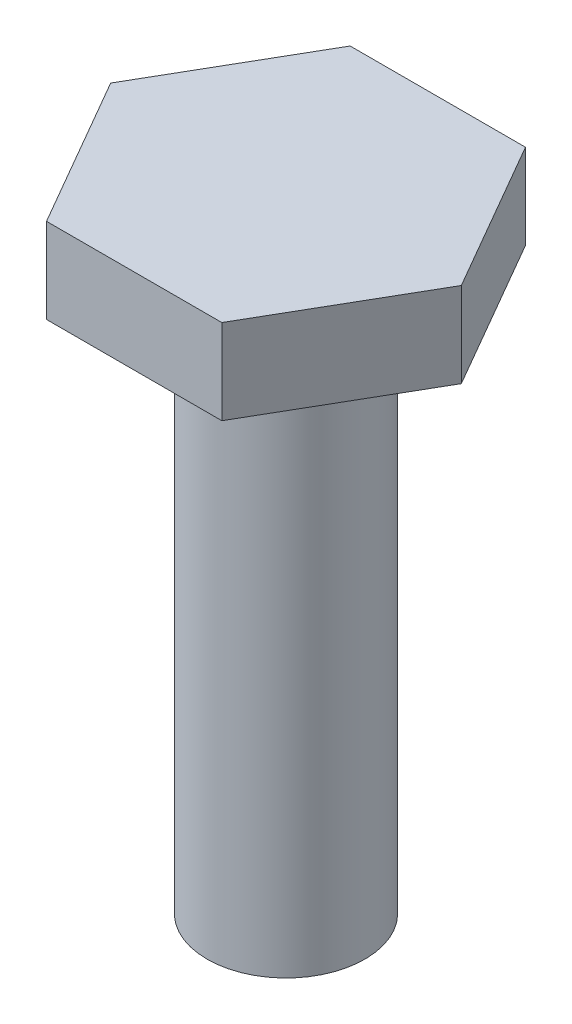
ISO-10303-21;
HEADER;
FILE_DESCRIPTION(('STEP AP214'),'2;1');
FILE_NAME('part.step','',(''),(''),'','','');
FILE_SCHEMA(('AUTOMOTIVE_DESIGN { 1 0 10303 214 1 1 1 1 }'));
ENDSEC;
DATA;
#1=APPLICATION_CONTEXT('core data for automotive mechanical design processes');
#2=APPLICATION_PROTOCOL_DEFINITION('international standard','automotive_design',2000,#1);
#3=PRODUCT_CONTEXT('',#1,'mechanical');
#4=PRODUCT('Part','Part','',(#3));
#5=PRODUCT_RELATED_PRODUCT_CATEGORY('part','',(#4));
#6=PRODUCT_DEFINITION_FORMATION('','',#4);
#7=PRODUCT_DEFINITION_CONTEXT('part definition',#1,'design');
#8=PRODUCT_DEFINITION('design','',#6,#7);
#9=PRODUCT_DEFINITION_SHAPE('','',#8);
#10=(LENGTH_UNIT() NAMED_UNIT(*) SI_UNIT(.MILLI.,.METRE.));
#11=(NAMED_UNIT(*) PLANE_ANGLE_UNIT() SI_UNIT($,.RADIAN.));
#12=(NAMED_UNIT(*) SI_UNIT($,.STERADIAN.) SOLID_ANGLE_UNIT());
#13=UNCERTAINTY_MEASURE_WITH_UNIT(LENGTH_MEASURE(1.E-05),#10,'distance_accuracy_value','');
#14=(GEOMETRIC_REPRESENTATION_CONTEXT(3) GLOBAL_UNCERTAINTY_ASSIGNED_CONTEXT((#13)) GLOBAL_UNIT_ASSIGNED_CONTEXT((#10,
#11,#12)) REPRESENTATION_CONTEXT('',''));
#15=CARTESIAN_POINT('',(0.,0.,0.));
#16=DIRECTION('',(0.,0.,1.));
#17=DIRECTION('',(1.,0.,0.));
#18=AXIS2_PLACEMENT_3D('',#15,#16,#17);
#19=CARTESIAN_POINT('',(0.,11.43,0.));
#20=DIRECTION('',(0.,-1.,0.));
#21=DIRECTION('',(0.,0.,-1.));
#22=AXIS2_PLACEMENT_3D('',#19,#20,#21);
#23=CYLINDRICAL_SURFACE('',#22,1.651);
#24=CARTESIAN_POINT('',(0.,11.43,0.));
#25=DIRECTION('',(0.,1.,0.));
#26=DIRECTION('',(0.,0.,1.));
#27=AXIS2_PLACEMENT_3D('',#24,#25,#26);
#28=CIRCLE('',#27,1.651);
#29=CARTESIAN_POINT('',(0.,11.43,1.651));
#30=VERTEX_POINT('',#29);
#31=EDGE_CURVE('E11',#30,#30,#28,.T.);
#32=ORIENTED_EDGE('',*,*,#31,.F.);
#33=EDGE_LOOP('',(#32));
#34=FACE_BOUND('',#33,.T.);
#35=CARTESIAN_POINT('',(0.,0.,0.));
#36=DIRECTION('',(0.,1.,0.));
#37=DIRECTION('',(0.,0.,1.));
#38=AXIS2_PLACEMENT_3D('',#35,#36,#37);
#39=CIRCLE('',#38,1.651);
#40=CARTESIAN_POINT('',(0.,0.,1.651));
#41=VERTEX_POINT('',#40);
#42=EDGE_CURVE('E48',#41,#41,#39,.T.);
#43=ORIENTED_EDGE('',*,*,#42,.T.);
#44=EDGE_LOOP('',(#43));
#45=FACE_BOUND('',#44,.T.);
#46=ADVANCED_FACE('F45',(#34,#45),#23,.T.);
#47=CARTESIAN_POINT('',(0.,0.,0.));
#48=DIRECTION('',(0.,1.,0.));
#49=DIRECTION('',(0.,0.,1.));
#50=AXIS2_PLACEMENT_3D('',#47,#48,#49);
#51=PLANE('',#50);
#52=ORIENTED_EDGE('',*,*,#42,.F.);
#53=EDGE_LOOP('',(#52));
#54=FACE_BOUND('',#53,.T.);
#55=ADVANCED_FACE('F170',(#54),#51,.F.);
#56=CARTESIAN_POINT('',(1.83308710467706,13.208,3.175));
#57=DIRECTION('',(-0.866025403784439,0.,-0.5));
#58=DIRECTION('',(-0.5,0.,0.866025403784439));
#59=AXIS2_PLACEMENT_3D('',#56,#57,#58);
#60=PLANE('',#59);
#61=DIRECTION('',(0.5,0.,-0.866025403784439));
#62=VECTOR('',#61,1.);
#63=CARTESIAN_POINT('',(1.83308710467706,11.43,3.175));
#64=LINE('',#63,#62);
#65=CARTESIAN_POINT('',(1.83308710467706,11.43,3.175));
#66=VERTEX_POINT('',#65);
#67=CARTESIAN_POINT('',(3.66617420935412,11.43,0.));
#68=VERTEX_POINT('',#67);
#69=EDGE_CURVE('E135',#66,#68,#64,.T.);
#70=ORIENTED_EDGE('',*,*,#69,.T.);
#71=DIRECTION('',(0.,-1.,0.));
#72=VECTOR('',#71,1.);
#73=CARTESIAN_POINT('',(3.66617420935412,13.208,0.));
#74=LINE('',#73,#72);
#75=CARTESIAN_POINT('',(3.66617420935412,13.208,0.));
#76=VERTEX_POINT('',#75);
#77=EDGE_CURVE('E162',#76,#68,#74,.T.);
#78=ORIENTED_EDGE('',*,*,#77,.F.);
#79=DIRECTION('',(0.5,0.,-0.866025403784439));
#80=VECTOR('',#79,1.);
#81=CARTESIAN_POINT('',(1.83308710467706,13.208,3.175));
#82=LINE('',#81,#80);
#83=CARTESIAN_POINT('',(1.83308710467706,13.208,3.175));
#84=VERTEX_POINT('',#83);
#85=EDGE_CURVE('E151',#84,#76,#82,.T.);
#86=ORIENTED_EDGE('',*,*,#85,.F.);
#87=DIRECTION('',(0.,-1.,0.));
#88=VECTOR('',#87,1.);
#89=CARTESIAN_POINT('',(1.83308710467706,13.208,3.175));
#90=LINE('',#89,#88);
#91=EDGE_CURVE('E131',#84,#66,#90,.T.);
#92=ORIENTED_EDGE('',*,*,#91,.T.);
#93=EDGE_LOOP('',(#70,#78,#86,#92));
#94=FACE_BOUND('',#93,.T.);
#95=ADVANCED_FACE('F172',(#94),#60,.F.);
#96=CARTESIAN_POINT('',(3.66617420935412,13.208,0.));
#97=DIRECTION('',(-0.866025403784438,0.,0.5));
#98=DIRECTION('',(0.5,0.,0.866025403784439));
#99=AXIS2_PLACEMENT_3D('',#96,#97,#98);
#100=PLANE('',#99);
#101=DIRECTION('',(-0.5,0.,-0.866025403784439));
#102=VECTOR('',#101,1.);
#103=CARTESIAN_POINT('',(3.66617420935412,11.43,0.));
#104=LINE('',#103,#102);
#105=CARTESIAN_POINT('',(1.83308710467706,11.43,-3.175));
#106=VERTEX_POINT('',#105);
#107=EDGE_CURVE('E139',#68,#106,#104,.T.);
#108=ORIENTED_EDGE('',*,*,#107,.T.);
#109=DIRECTION('',(0.,-1.,0.));
#110=VECTOR('',#109,1.);
#111=CARTESIAN_POINT('',(1.83308710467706,13.208,-3.175));
#112=LINE('',#111,#110);
#113=CARTESIAN_POINT('',(1.83308710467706,13.208,-3.175));
#114=VERTEX_POINT('',#113);
#115=EDGE_CURVE('E158',#114,#106,#112,.T.);
#116=ORIENTED_EDGE('',*,*,#115,.F.);
#117=DIRECTION('',(-0.5,0.,-0.866025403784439));
#118=VECTOR('',#117,1.);
#119=CARTESIAN_POINT('',(3.66617420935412,13.208,0.));
#120=LINE('',#119,#118);
#121=EDGE_CURVE('E100',#76,#114,#120,.T.);
#122=ORIENTED_EDGE('',*,*,#121,.F.);
#123=ORIENTED_EDGE('',*,*,#77,.T.);
#124=EDGE_LOOP('',(#108,#116,#122,#123));
#125=FACE_BOUND('',#124,.T.);
#126=ADVANCED_FACE('F177',(#125),#100,.F.);
#127=CARTESIAN_POINT('',(1.83308710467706,13.208,-3.175));
#128=DIRECTION('',(0.,0.,1.));
#129=DIRECTION('',(1.,0.,0.));
#130=AXIS2_PLACEMENT_3D('',#127,#128,#129);
#131=PLANE('',#130);
#132=DIRECTION('',(-1.,0.,0.));
#133=VECTOR('',#132,1.);
#134=CARTESIAN_POINT('',(1.83308710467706,11.43,-3.175));
#135=LINE('',#134,#133);
#136=CARTESIAN_POINT('',(-1.83308710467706,11.43,-3.175));
#137=VERTEX_POINT('',#136);
#138=EDGE_CURVE('E142',#106,#137,#135,.T.);
#139=ORIENTED_EDGE('',*,*,#138,.T.);
#140=DIRECTION('',(0.,-1.,0.));
#141=VECTOR('',#140,1.);
#142=CARTESIAN_POINT('',(-1.83308710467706,13.208,-3.175));
#143=LINE('',#142,#141);
#144=CARTESIAN_POINT('',(-1.83308710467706,13.208,-3.175));
#145=VERTEX_POINT('',#144);
#146=EDGE_CURVE('E124',#145,#137,#143,.T.);
#147=ORIENTED_EDGE('',*,*,#146,.F.);
#148=DIRECTION('',(-1.,0.,0.));
#149=VECTOR('',#148,1.);
#150=CARTESIAN_POINT('',(1.83308710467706,13.208,-3.175));
#151=LINE('',#150,#149);
#152=EDGE_CURVE('E113',#114,#145,#151,.T.);
#153=ORIENTED_EDGE('',*,*,#152,.F.);
#154=ORIENTED_EDGE('',*,*,#115,.T.);
#155=EDGE_LOOP('',(#139,#147,#153,#154));
#156=FACE_BOUND('',#155,.T.);
#157=ADVANCED_FACE('F184',(#156),#131,.F.);
#158=CARTESIAN_POINT('',(-1.83308710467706,13.208,-3.175));
#159=DIRECTION('',(0.866025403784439,0.,0.5));
#160=DIRECTION('',(0.5,0.,-0.866025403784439));
#161=AXIS2_PLACEMENT_3D('',#158,#159,#160);
#162=PLANE('',#161);
#163=DIRECTION('',(-0.5,0.,0.866025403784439));
#164=VECTOR('',#163,1.);
#165=CARTESIAN_POINT('',(-1.83308710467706,11.43,-3.175));
#166=LINE('',#165,#164);
#167=CARTESIAN_POINT('',(-3.66617420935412,11.43,0.));
#168=VERTEX_POINT('',#167);
#169=EDGE_CURVE('E122',#137,#168,#166,.T.);
#170=ORIENTED_EDGE('',*,*,#169,.T.);
#171=DIRECTION('',(0.,-1.,0.));
#172=VECTOR('',#171,1.);
#173=CARTESIAN_POINT('',(-3.66617420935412,13.208,0.));
#174=LINE('',#173,#172);
#175=CARTESIAN_POINT('',(-3.66617420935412,13.208,0.));
#176=VERTEX_POINT('',#175);
#177=EDGE_CURVE('E119',#176,#168,#174,.T.);
#178=ORIENTED_EDGE('',*,*,#177,.F.);
#179=DIRECTION('',(-0.5,0.,0.866025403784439));
#180=VECTOR('',#179,1.);
#181=CARTESIAN_POINT('',(-1.83308710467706,13.208,-3.175));
#182=LINE('',#181,#180);
#183=EDGE_CURVE('E107',#145,#176,#182,.T.);
#184=ORIENTED_EDGE('',*,*,#183,.F.);
#185=ORIENTED_EDGE('',*,*,#146,.T.);
#186=EDGE_LOOP('',(#170,#178,#184,#185));
#187=FACE_BOUND('',#186,.T.);
#188=ADVANCED_FACE('F120',(#187),#162,.F.);
#189=CARTESIAN_POINT('',(-3.66617420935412,13.208,0.));
#190=DIRECTION('',(0.866025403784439,0.,-0.5));
#191=DIRECTION('',(-0.5,0.,-0.866025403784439));
#192=AXIS2_PLACEMENT_3D('',#189,#190,#191);
#193=PLANE('',#192);
#194=DIRECTION('',(0.5,0.,0.866025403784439));
#195=VECTOR('',#194,1.);
#196=CARTESIAN_POINT('',(-3.66617420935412,11.43,0.));
#197=LINE('',#196,#195);
#198=CARTESIAN_POINT('',(-1.83308710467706,11.43,3.175));
#199=VERTEX_POINT('',#198);
#200=EDGE_CURVE('E85',#168,#199,#197,.T.);
#201=ORIENTED_EDGE('',*,*,#200,.T.);
#202=DIRECTION('',(0.,-1.,0.));
#203=VECTOR('',#202,1.);
#204=CARTESIAN_POINT('',(-1.83308710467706,13.208,3.175));
#205=LINE('',#204,#203);
#206=CARTESIAN_POINT('',(-1.83308710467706,13.208,3.175));
#207=VERTEX_POINT('',#206);
#208=EDGE_CURVE('E125',#207,#199,#205,.T.);
#209=ORIENTED_EDGE('',*,*,#208,.F.);
#210=DIRECTION('',(0.5,0.,0.866025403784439));
#211=VECTOR('',#210,1.);
#212=CARTESIAN_POINT('',(-3.66617420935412,13.208,0.));
#213=LINE('',#212,#211);
#214=EDGE_CURVE('E111',#176,#207,#213,.T.);
#215=ORIENTED_EDGE('',*,*,#214,.F.);
#216=ORIENTED_EDGE('',*,*,#177,.T.);
#217=EDGE_LOOP('',(#201,#209,#215,#216));
#218=FACE_BOUND('',#217,.T.);
#219=ADVANCED_FACE('F127',(#218),#193,.F.);
#220=CARTESIAN_POINT('',(-1.83308710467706,13.208,3.175));
#221=DIRECTION('',(0.,0.,-1.));
#222=DIRECTION('',(-1.,0.,0.));
#223=AXIS2_PLACEMENT_3D('',#220,#221,#222);
#224=PLANE('',#223);
#225=DIRECTION('',(1.,0.,0.));
#226=VECTOR('',#225,1.);
#227=CARTESIAN_POINT('',(-1.83308710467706,11.43,3.175));
#228=LINE('',#227,#226);
#229=EDGE_CURVE('E91',#199,#66,#228,.T.);
#230=ORIENTED_EDGE('',*,*,#229,.T.);
#231=ORIENTED_EDGE('',*,*,#91,.F.);
#232=DIRECTION('',(1.,0.,0.));
#233=VECTOR('',#232,1.);
#234=CARTESIAN_POINT('',(-1.83308710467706,13.208,3.175));
#235=LINE('',#234,#233);
#236=EDGE_CURVE('E62',#207,#84,#235,.T.);
#237=ORIENTED_EDGE('',*,*,#236,.F.);
#238=ORIENTED_EDGE('',*,*,#208,.T.);
#239=EDGE_LOOP('',(#230,#231,#237,#238));
#240=FACE_BOUND('',#239,.T.);
#241=ADVANCED_FACE('F192',(#240),#224,.F.);
#242=CARTESIAN_POINT('',(0.,13.208,0.));
#243=DIRECTION('',(0.,1.,0.));
#244=DIRECTION('',(0.,0.,1.));
#245=AXIS2_PLACEMENT_3D('',#242,#243,#244);
#246=PLANE('',#245);
#247=ORIENTED_EDGE('',*,*,#85,.T.);
#248=ORIENTED_EDGE('',*,*,#121,.T.);
#249=ORIENTED_EDGE('',*,*,#152,.T.);
#250=ORIENTED_EDGE('',*,*,#183,.T.);
#251=ORIENTED_EDGE('',*,*,#214,.T.);
#252=ORIENTED_EDGE('',*,*,#236,.T.);
#253=EDGE_LOOP('',(#247,#248,#249,#250,#251,#252));
#254=FACE_BOUND('',#253,.T.);
#255=ADVANCED_FACE('F109',(#254),#246,.T.);
#256=CARTESIAN_POINT('',(0.,11.43,0.));
#257=DIRECTION('',(0.,1.,0.));
#258=DIRECTION('',(0.,0.,1.));
#259=AXIS2_PLACEMENT_3D('',#256,#257,#258);
#260=PLANE('',#259);
#261=ORIENTED_EDGE('',*,*,#31,.T.);
#262=EDGE_LOOP('',(#261));
#263=FACE_BOUND('',#262,.T.);
#264=ORIENTED_EDGE('',*,*,#69,.F.);
#265=ORIENTED_EDGE('',*,*,#229,.F.);
#266=ORIENTED_EDGE('',*,*,#200,.F.);
#267=ORIENTED_EDGE('',*,*,#169,.F.);
#268=ORIENTED_EDGE('',*,*,#138,.F.);
#269=ORIENTED_EDGE('',*,*,#107,.F.);
#270=EDGE_LOOP('',(#264,#265,#266,#267,#268,#269));
#271=FACE_BOUND('',#270,.T.);
#272=ADVANCED_FACE('F195',(#263,#271),#260,.F.);
#273=CLOSED_SHELL('',(#46,#55,#95,#126,#157,#188,#219,#241,#255,#272));
#274=MANIFOLD_SOLID_BREP('B2',#273);
#275=ADVANCED_BREP_SHAPE_REPRESENTATION('',(#18,#274),#14);
#276=SHAPE_DEFINITION_REPRESENTATION(#9,#275);
ENDSEC;
END-ISO-10303-21;
